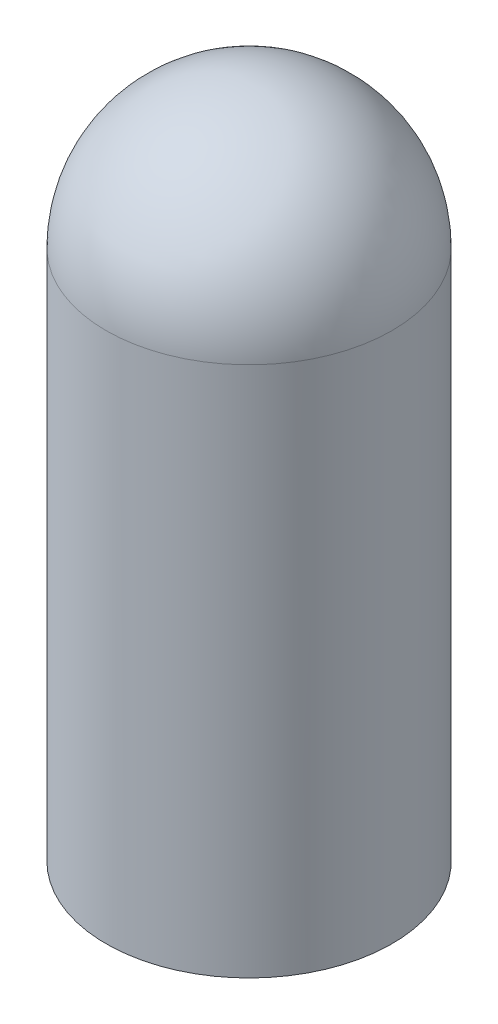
from build123d import *


with BuildPart() as part:
    # Sketch1 → Revolve1 (revolve)
    with BuildSketch(Plane.XY, mode=Mode.PRIVATE) as revolve1_sk:
        with BuildLine():
            Line((8.89, 33.02), (8.89, 0))
            Line((8.89, 0), (0, 0))
            Line((0, 0), (0, 41.91))
            ThreePointArc((0, 41.91), (6.286179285, 39.306179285), (8.89, 33.02))
        make_face()
    revolve(revolve1_sk.sketch.rotate(Axis((0, 0, 0), (0, 1, 0)), 90), axis=Axis((0, 0, 0), (0, 1, 0)))


solid = part.part
